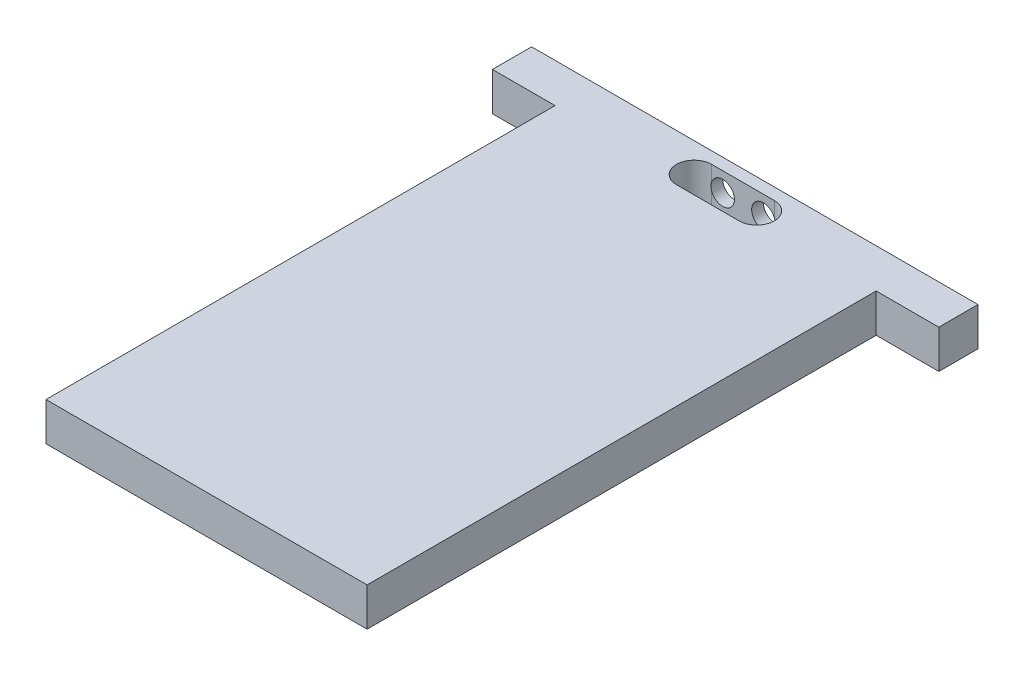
from build123d import *

# Parameters (mm, degrees)
SKETCH1_W           = 41
SKETCH1_H           = 4.9
BOSS_EXTRUDE1_DEPTH = 32.5
SKETCH2_W           = 57
SKETCH2_H           = 4.9
BOSS_EXTRUDE2_DEPTH = 5
CUT_EXTRUDE1_DEPTH  = 48.355147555
CUT_EXTRUDE2_REACH  = 77.619
SKETCH4_R           = 1.5


with BuildPart() as part:
    # Sketch1 → Boss-Extrude1 (new, symmetric)
    with BuildSketch(Plane.XY):
        Rectangle(SKETCH1_W, SKETCH1_H)
    extrude(amount=BOSS_EXTRUDE1_DEPTH, both=True)

    # Sketch2 → Boss-Extrude2 (add)
    with BuildSketch(Plane.XY.offset(-32.5)):
        Rectangle(SKETCH2_W, SKETCH2_H)
    extrude(amount=-BOSS_EXTRUDE2_DEPTH)

    # Sketch3 → Cut-Extrude1 (cut, through all)
    with BuildSketch(Plane(origin=(0, 2.45, 0), x_dir=(1, 0, 0), z_dir=(0, 1, 0))):
        with BuildLine():
            Line((-4, 36), (4, 36))
            ThreePointArc((4, 36), (6.25, 33.75), (4, 31.5))
            Line((4, 31.5), (-4, 31.5))
            ThreePointArc((-4, 31.5), (-6.25, 33.75), (-4, 36))
        make_face()
    extrude(amount=-CUT_EXTRUDE1_DEPTH, mode=Mode.SUBTRACT)

    # Sketch4 → Cut-Extrude2 (cut, up to next)
    with BuildSketch(Plane(origin=(0, 0, -37.5), x_dir=(-1, 0, 0), z_dir=(0, 0, -1)), mode=Mode.PRIVATE) as cut_extrude2_sk1:
        with Locations((2.6, 0)):
            Circle(SKETCH4_R)
    cut_extrude2_tool1 = extrude(cut_extrude2_sk1.sketch, amount=-CUT_EXTRUDE2_REACH, mode=Mode.PRIVATE) & part.part
    # Sketch4 → Cut-Extrude2 (cut, up to next)
    with BuildSketch(Plane(origin=(0, 0, -37.5), x_dir=(-1, 0, 0), z_dir=(0, 0, -1)), mode=Mode.PRIVATE) as cut_extrude2_sk2:
        with Locations(Location((-2.6, 0, 0), (0, 0, 201.039469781))):
            Circle(SKETCH4_R)
    cut_extrude2_tool2 = extrude(cut_extrude2_sk2.sketch, amount=-CUT_EXTRUDE2_REACH, mode=Mode.PRIVATE) & part.part
    add(cut_extrude2_tool1.solids().sort_by_distance((-2.6, 0, -37.5))[0], mode=Mode.SUBTRACT)
    add(cut_extrude2_tool2.solids().sort_by_distance((2.6, 0, -37.5))[0], mode=Mode.SUBTRACT)


solid = part.part
